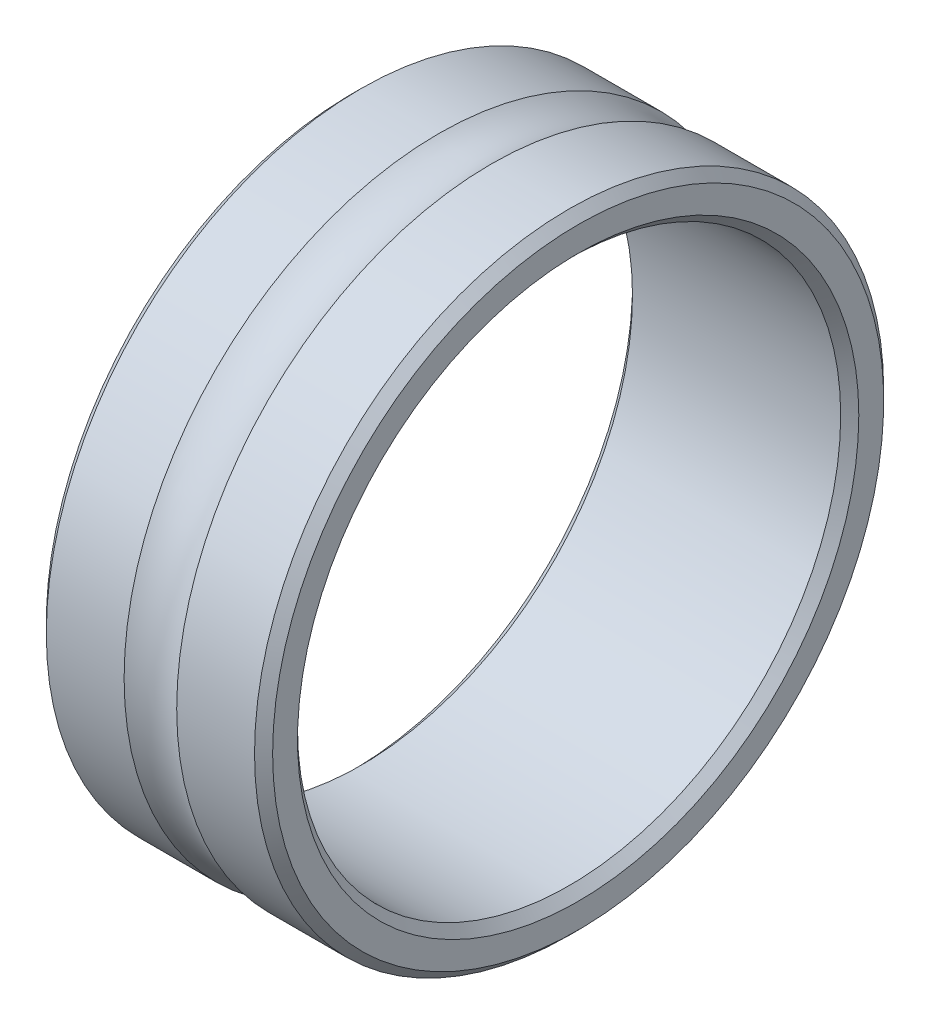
ISO-10303-21;
HEADER;
FILE_DESCRIPTION(('STEP AP214'),'2;1');
FILE_NAME('part.step','',(''),(''),'','','');
FILE_SCHEMA(('AUTOMOTIVE_DESIGN { 1 0 10303 214 1 1 1 1 }'));
ENDSEC;
DATA;
#1=APPLICATION_CONTEXT('core data for automotive mechanical design processes');
#2=APPLICATION_PROTOCOL_DEFINITION('international standard','automotive_design',2000,#1);
#3=PRODUCT_CONTEXT('',#1,'mechanical');
#4=PRODUCT('Part','Part','',(#3));
#5=PRODUCT_RELATED_PRODUCT_CATEGORY('part','',(#4));
#6=PRODUCT_DEFINITION_FORMATION('','',#4);
#7=PRODUCT_DEFINITION_CONTEXT('part definition',#1,'design');
#8=PRODUCT_DEFINITION('design','',#6,#7);
#9=PRODUCT_DEFINITION_SHAPE('','',#8);
#10=(LENGTH_UNIT() NAMED_UNIT(*) SI_UNIT(.MILLI.,.METRE.));
#11=(NAMED_UNIT(*) PLANE_ANGLE_UNIT() SI_UNIT($,.RADIAN.));
#12=(NAMED_UNIT(*) SI_UNIT($,.STERADIAN.) SOLID_ANGLE_UNIT());
#13=UNCERTAINTY_MEASURE_WITH_UNIT(LENGTH_MEASURE(1.E-05),#10,'distance_accuracy_value','');
#14=(GEOMETRIC_REPRESENTATION_CONTEXT(3) GLOBAL_UNCERTAINTY_ASSIGNED_CONTEXT((#13)) GLOBAL_UNIT_ASSIGNED_CONTEXT((#10,
#11,#12)) REPRESENTATION_CONTEXT('',''));
#15=CARTESIAN_POINT('',(0.,0.,0.));
#16=DIRECTION('',(0.,0.,1.));
#17=DIRECTION('',(1.,0.,0.));
#18=AXIS2_PLACEMENT_3D('',#15,#16,#17);
#19=CARTESIAN_POINT('',(0.,0.,0.));
#20=DIRECTION('',(-1.,0.,0.));
#21=DIRECTION('',(0.,0.,1.));
#22=AXIS2_PLACEMENT_3D('',#19,#20,#21);
#23=TOROIDAL_SURFACE('',#22,4.,0.6);
#24=CARTESIAN_POINT('',(-0.290473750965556,0.,0.));
#25=DIRECTION('',(-1.,0.,0.));
#26=DIRECTION('',(0.,0.,1.));
#27=AXIS2_PLACEMENT_3D('',#24,#25,#26);
#28=CIRCLE('',#27,3.475);
#29=CARTESIAN_POINT('',(-0.290473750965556,0.,3.475));
#30=VERTEX_POINT('',#29);
#31=EDGE_CURVE('E41',#30,#30,#28,.T.);
#32=ORIENTED_EDGE('',*,*,#31,.F.);
#33=EDGE_LOOP('',(#32));
#34=FACE_BOUND('',#33,.T.);
#35=CARTESIAN_POINT('',(0.290473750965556,0.,0.));
#36=DIRECTION('',(-1.,0.,0.));
#37=DIRECTION('',(0.,0.,1.));
#38=AXIS2_PLACEMENT_3D('',#35,#36,#37);
#39=CIRCLE('',#38,3.475);
#40=CARTESIAN_POINT('',(0.290473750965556,0.,3.475));
#41=VERTEX_POINT('',#40);
#42=EDGE_CURVE('E38',#41,#41,#39,.F.);
#43=ORIENTED_EDGE('',*,*,#42,.F.);
#44=EDGE_LOOP('',(#43));
#45=FACE_BOUND('',#44,.T.);
#46=ADVANCED_FACE('F15',(#34,#45),#23,.F.);
#47=CARTESIAN_POINT('',(-2.07908825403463,0.,0.));
#48=DIRECTION('',(-1.,0.,0.));
#49=DIRECTION('',(0.,0.,1.));
#50=AXIS2_PLACEMENT_3D('',#47,#48,#49);
#51=CYLINDRICAL_SURFACE('',#50,3.475);
#52=ORIENTED_EDGE('',*,*,#31,.T.);
#53=EDGE_LOOP('',(#52));
#54=FACE_BOUND('',#53,.T.);
#55=CARTESIAN_POINT('',(-1.15000000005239,0.,0.));
#56=DIRECTION('',(1.,0.,0.));
#57=DIRECTION('',(0.,0.,-1.));
#58=AXIS2_PLACEMENT_3D('',#55,#56,#57);
#59=CIRCLE('',#58,3.4750000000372);
#60=CARTESIAN_POINT('',(-1.15000000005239,0.,-3.4750000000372));
#61=VERTEX_POINT('',#60);
#62=EDGE_CURVE('E35',#61,#61,#59,.F.);
#63=ORIENTED_EDGE('',*,*,#62,.F.);
#64=EDGE_LOOP('',(#63));
#65=FACE_BOUND('',#64,.T.);
#66=ADVANCED_FACE('F95',(#54,#65),#51,.T.);
#67=CARTESIAN_POINT('',(-2.07908825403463,0.,0.));
#68=DIRECTION('',(-1.,0.,0.));
#69=DIRECTION('',(0.,0.,1.));
#70=AXIS2_PLACEMENT_3D('',#67,#68,#69);
#71=CYLINDRICAL_SURFACE('',#70,3.475);
#72=CARTESIAN_POINT('',(1.14999999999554,0.,0.));
#73=DIRECTION('',(-1.,0.,0.));
#74=DIRECTION('',(0.,0.,1.));
#75=AXIS2_PLACEMENT_3D('',#72,#73,#74);
#76=CIRCLE('',#75,3.47499999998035);
#77=CARTESIAN_POINT('',(1.14999999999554,0.,3.47499999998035));
#78=VERTEX_POINT('',#77);
#79=EDGE_CURVE('E32',#78,#78,#76,.F.);
#80=ORIENTED_EDGE('',*,*,#79,.F.);
#81=EDGE_LOOP('',(#80));
#82=FACE_BOUND('',#81,.T.);
#83=ORIENTED_EDGE('',*,*,#42,.T.);
#84=EDGE_LOOP('',(#83));
#85=FACE_BOUND('',#84,.T.);
#86=ADVANCED_FACE('F92',(#82,#85),#71,.T.);
#87=CARTESIAN_POINT('',(-1.15000000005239,0.,0.));
#88=DIRECTION('',(1.,0.,0.));
#89=DIRECTION('',(0.,0.,-1.));
#90=AXIS2_PLACEMENT_3D('',#87,#88,#89);
#91=CONICAL_SURFACE('',#90,3.4750000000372,0.785398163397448);
#92=CARTESIAN_POINT('',(-1.25000000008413,0.,0.));
#93=DIRECTION('',(1.,0.,0.));
#94=DIRECTION('',(0.,0.,-1.));
#95=AXIS2_PLACEMENT_3D('',#92,#93,#94);
#96=CIRCLE('',#95,3.37500000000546);
#97=CARTESIAN_POINT('',(-1.25000000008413,0.,-3.37500000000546));
#98=VERTEX_POINT('',#97);
#99=EDGE_CURVE('E19',#98,#98,#96,.T.);
#100=ORIENTED_EDGE('',*,*,#99,.T.);
#101=EDGE_LOOP('',(#100));
#102=FACE_BOUND('',#101,.T.);
#103=ORIENTED_EDGE('',*,*,#62,.T.);
#104=EDGE_LOOP('',(#103));
#105=FACE_BOUND('',#104,.T.);
#106=ADVANCED_FACE('F55',(#102,#105),#91,.T.);
#107=CARTESIAN_POINT('',(1.15000000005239,0.,0.));
#108=DIRECTION('',(-1.,0.,0.));
#109=DIRECTION('',(0.,0.,1.));
#110=AXIS2_PLACEMENT_3D('',#107,#108,#109);
#111=CONICAL_SURFACE('',#110,3.47499999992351,0.785398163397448);
#112=CARTESIAN_POINT('',(1.25000000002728,0.,0.));
#113=DIRECTION('',(-1.,0.,0.));
#114=DIRECTION('',(0.,0.,1.));
#115=AXIS2_PLACEMENT_3D('',#112,#113,#114);
#116=CIRCLE('',#115,3.37499999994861);
#117=CARTESIAN_POINT('',(1.25000000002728,0.,3.37499999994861));
#118=VERTEX_POINT('',#117);
#119=EDGE_CURVE('E48',#118,#118,#116,.T.);
#120=ORIENTED_EDGE('',*,*,#119,.T.);
#121=EDGE_LOOP('',(#120));
#122=FACE_BOUND('',#121,.T.);
#123=ORIENTED_EDGE('',*,*,#79,.T.);
#124=EDGE_LOOP('',(#123));
#125=FACE_BOUND('',#124,.T.);
#126=ADVANCED_FACE('F62',(#122,#125),#111,.T.);
#127=CARTESIAN_POINT('',(-1.25,3.475,0.));
#128=DIRECTION('',(1.,0.,0.));
#129=DIRECTION('',(0.,0.,-1.));
#130=AXIS2_PLACEMENT_3D('',#127,#128,#129);
#131=PLANE('',#130);
#132=ORIENTED_EDGE('',*,*,#99,.F.);
#133=EDGE_LOOP('',(#132));
#134=FACE_BOUND('',#133,.T.);
#135=CARTESIAN_POINT('',(-1.24999999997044,0.,0.));
#136=DIRECTION('',(-1.,0.,0.));
#137=DIRECTION('',(0.,0.,1.));
#138=AXIS2_PLACEMENT_3D('',#135,#136,#137);
#139=CIRCLE('',#138,3.10000000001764);
#140=CARTESIAN_POINT('',(-1.24999999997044,0.,3.10000000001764));
#141=VERTEX_POINT('',#140);
#142=EDGE_CURVE('E46',#141,#141,#139,.F.);
#143=ORIENTED_EDGE('',*,*,#142,.T.);
#144=EDGE_LOOP('',(#143));
#145=FACE_BOUND('',#144,.T.);
#146=ADVANCED_FACE('F58',(#134,#145),#131,.F.);
#147=CARTESIAN_POINT('',(1.25,3.475,0.));
#148=DIRECTION('',(-1.,0.,0.));
#149=DIRECTION('',(0.,0.,1.));
#150=AXIS2_PLACEMENT_3D('',#147,#148,#149);
#151=PLANE('',#150);
#152=ORIENTED_EDGE('',*,*,#119,.F.);
#153=EDGE_LOOP('',(#152));
#154=FACE_BOUND('',#153,.T.);
#155=CARTESIAN_POINT('',(1.24999999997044,0.,0.));
#156=DIRECTION('',(1.,0.,0.));
#157=DIRECTION('',(0.,0.,-1.));
#158=AXIS2_PLACEMENT_3D('',#155,#156,#157);
#159=CIRCLE('',#158,3.10000000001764);
#160=CARTESIAN_POINT('',(1.24999999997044,0.,-3.10000000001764));
#161=VERTEX_POINT('',#160);
#162=EDGE_CURVE('E28',#161,#161,#159,.F.);
#163=ORIENTED_EDGE('',*,*,#162,.T.);
#164=EDGE_LOOP('',(#163));
#165=FACE_BOUND('',#164,.T.);
#166=ADVANCED_FACE('F61',(#154,#165),#151,.F.);
#167=CARTESIAN_POINT('',(-1.2499999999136,0.,0.));
#168=DIRECTION('',(-1.,0.,0.));
#169=DIRECTION('',(0.,0.,1.));
#170=AXIS2_PLACEMENT_3D('',#167,#168,#169);
#171=CONICAL_SURFACE('',#170,3.0999999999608,0.785398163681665);
#172=ORIENTED_EDGE('',*,*,#142,.F.);
#173=EDGE_LOOP('',(#172));
#174=FACE_BOUND('',#173,.T.);
#175=CARTESIAN_POINT('',(-1.15,0.,0.));
#176=DIRECTION('',(-1.,0.,0.));
#177=DIRECTION('',(0.,0.,1.));
#178=AXIS2_PLACEMENT_3D('',#175,#176,#177);
#179=CIRCLE('',#178,3.);
#180=CARTESIAN_POINT('',(-1.15,0.,3.));
#181=VERTEX_POINT('',#180);
#182=EDGE_CURVE('E23',#181,#181,#179,.F.);
#183=ORIENTED_EDGE('',*,*,#182,.T.);
#184=EDGE_LOOP('',(#183));
#185=FACE_BOUND('',#184,.T.);
#186=ADVANCED_FACE('F66',(#174,#185),#171,.F.);
#187=CARTESIAN_POINT('',(1.24999999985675,0.,0.));
#188=DIRECTION('',(1.,0.,0.));
#189=DIRECTION('',(0.,0.,-1.));
#190=AXIS2_PLACEMENT_3D('',#187,#188,#189);
#191=CONICAL_SURFACE('',#190,3.09999999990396,0.785398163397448);
#192=CARTESIAN_POINT('',(1.15,0.,0.));
#193=DIRECTION('',(-1.,0.,0.));
#194=DIRECTION('',(0.,0.,1.));
#195=AXIS2_PLACEMENT_3D('',#192,#193,#194);
#196=CIRCLE('',#195,3.);
#197=CARTESIAN_POINT('',(1.15,0.,3.));
#198=VERTEX_POINT('',#197);
#199=EDGE_CURVE('E10',#198,#198,#196,.T.);
#200=ORIENTED_EDGE('',*,*,#199,.T.);
#201=EDGE_LOOP('',(#200));
#202=FACE_BOUND('',#201,.T.);
#203=ORIENTED_EDGE('',*,*,#162,.F.);
#204=EDGE_LOOP('',(#203));
#205=FACE_BOUND('',#204,.T.);
#206=ADVANCED_FACE('F69',(#202,#205),#191,.F.);
#207=CARTESIAN_POINT('',(-2.07908825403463,0.,0.));
#208=DIRECTION('',(-1.,0.,0.));
#209=DIRECTION('',(0.,0.,1.));
#210=AXIS2_PLACEMENT_3D('',#207,#208,#209);
#211=CYLINDRICAL_SURFACE('',#210,3.);
#212=ORIENTED_EDGE('',*,*,#182,.F.);
#213=EDGE_LOOP('',(#212));
#214=FACE_BOUND('',#213,.T.);
#215=ORIENTED_EDGE('',*,*,#199,.F.);
#216=EDGE_LOOP('',(#215));
#217=FACE_BOUND('',#216,.T.);
#218=ADVANCED_FACE('F17',(#214,#217),#211,.F.);
#219=CLOSED_SHELL('',(#46,#66,#86,#106,#126,#146,#166,#186,#206,#218));
#220=MANIFOLD_SOLID_BREP('B1',#219);
#221=ADVANCED_BREP_SHAPE_REPRESENTATION('',(#18,#220),#14);
#222=SHAPE_DEFINITION_REPRESENTATION(#9,#221);
ENDSEC;
END-ISO-10303-21;
